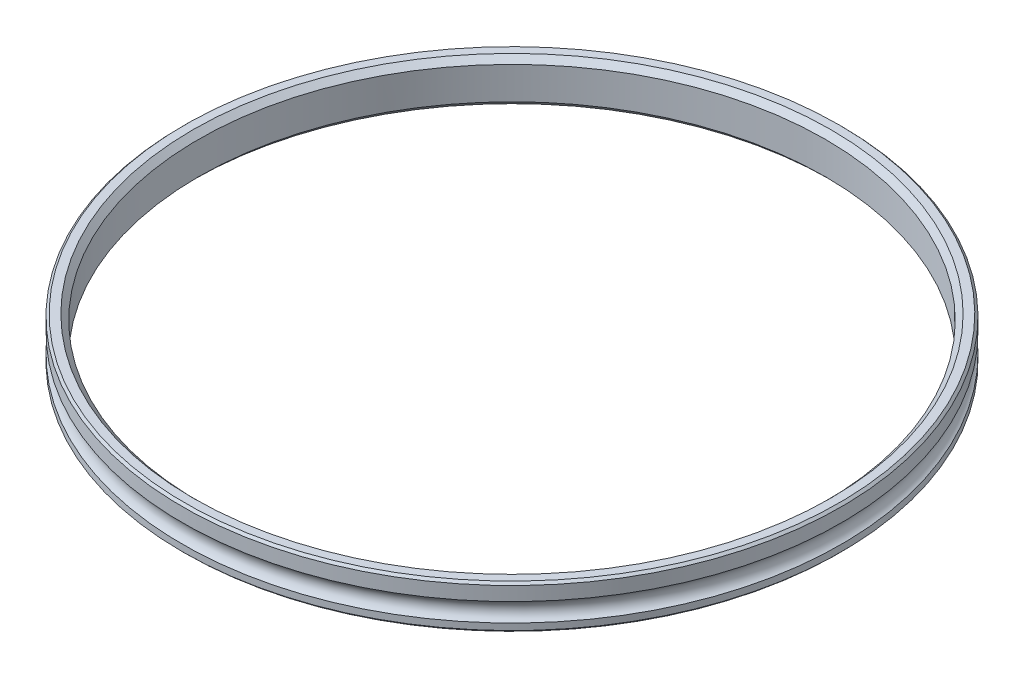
from build123d import *

# Parameters (mm, degrees)
SKETCH1_W              = 2.9337
SKETCH1_H              = 7.9375
CHAMFER_I_D_EDGE_SIZE  = 1.016
CHAMFER_SEAL_SEAT_SIZE = 0.41275


with BuildPart() as part:
    # Sketch1 → Base-Revolve (revolve)
    with BuildSketch(Plane.XY, mode=Mode.PRIVATE) as base_revolve_sk:
        with Locations((-58.61685, 0.67437)):
            Rectangle(SKETCH1_W, SKETCH1_H)
    revolve(base_revolve_sk.sketch.rotate(Axis((0, 0, 0), (0, 1, 0)), 270), axis=Axis((0, 0, 0), (0, 1, 0)))

    # Sketch2 → Cut-Revolve Path (revolve, cut)
    with BuildSketch(Plane.XY, mode=Mode.PRIVATE) as cut_revolve_path_sk:
        with BuildLine():
            Line((-60.0837, -1.692304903), (-60.0837, 1.692304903))
            ThreePointArc((-60.0837, 1.692304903), (-59.13501, 0), (-60.0837, -1.692304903))
        make_face()
    revolve(cut_revolve_path_sk.sketch.rotate(Axis((0, 0, 0), (0, 1, 0)), 270), axis=Axis((0, 0, 0), (0, 1, 0)), mode=Mode.SUBTRACT)

    # Chamfer I.D. Edge
    chamfer_i_d_edge_edges = [part.edges().sort_by_distance(p)[0] for p in [
        (0, -3.29438, 57.15),
        (0, 4.64312, 57.15),
    ]]
    chamfer(chamfer_i_d_edge_edges, length=CHAMFER_I_D_EDGE_SIZE)

    # Chamfer Seal Seat
    chamfer_seal_seat_edges = [part.edges().sort_by_distance(p)[0] for p in [
        (0, -3.29438, 60.0837),
        (0, 4.64312, 60.0837),
    ]]
    chamfer(chamfer_seal_seat_edges, length=CHAMFER_SEAL_SEAT_SIZE)


solid = part.part
